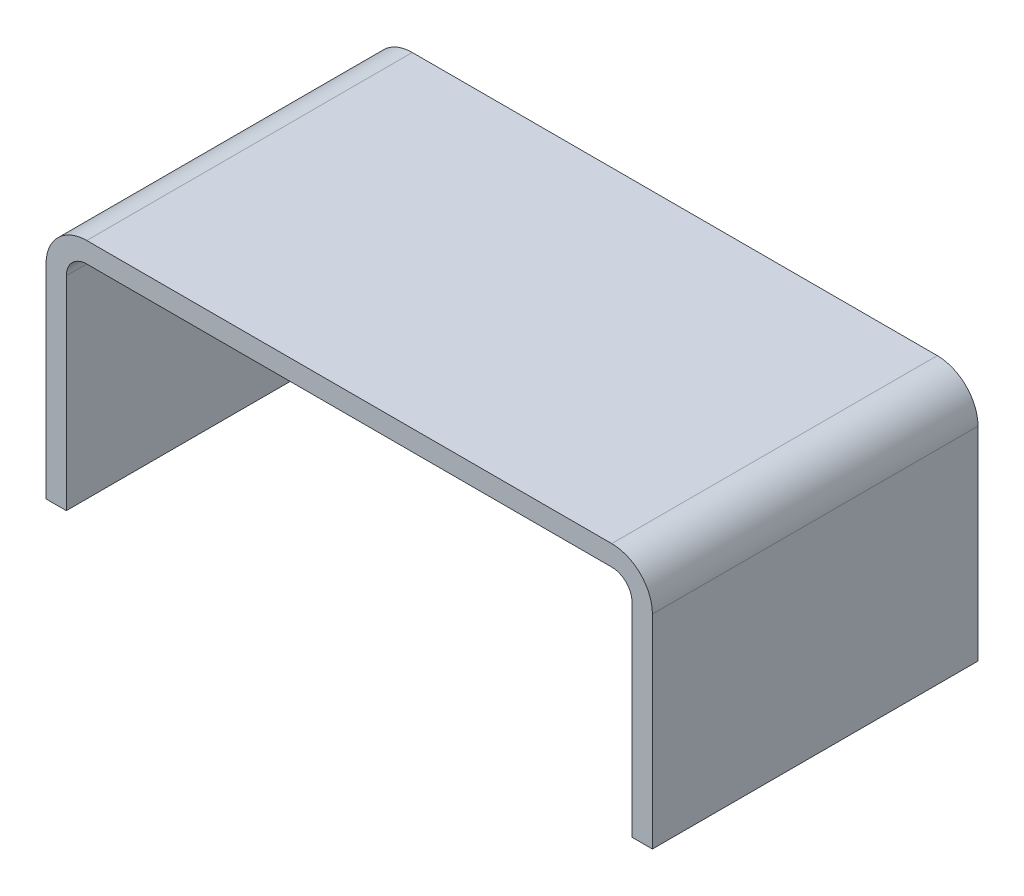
from build123d import *

# Parameters (mm, degrees)
BASE_EXTRUSION_DEPTH    = 1000
ESQUISSE2_W             = 300
ESQUISSE2_H             = 1040
ENL_V_MAT_EXTRU_1_DEPTH = 1013.818345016


with BuildPart() as part:
    # Esquisse1 → Base-Extrusion (new body)
    with BuildSketch(Plane.XY):
        with BuildLine():
            Line((144, 0), (149, 0))
            Line((149, 0), (149, 50))
            ThreePointArc((149, 50), (146.071067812, 57.071067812), (139, 60))
            Line((139, 60), (10, 60))
            ThreePointArc((10, 60), (2.928932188, 57.071067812), (0, 50))
            Line((0, 50), (0, 0))
            Line((0, 0), (5, 0))
            Line((5, 0), (5, 50))
            ThreePointArc((5, 50), (6.464466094, 53.535533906), (10, 55))
            Line((10, 55), (139, 55))
            ThreePointArc((139, 55), (142.535533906, 53.535533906), (144, 50))
            Line((144, 50), (144, 0))
        make_face()
    extrude(amount=BASE_EXTRUSION_DEPTH)

    # Esquisse2 → Enl_v. mat.-Extru.1 (cut, through all)
    with BuildSketch(Plane(origin=(0, 60, 0), x_dir=(-1, 0, 0), z_dir=(0, 1, 0))):
        with Locations((-90, 400)):
            Rectangle(ESQUISSE2_W, ESQUISSE2_H)
    extrude(amount=-ENL_V_MAT_EXTRU_1_DEPTH, mode=Mode.SUBTRACT)


solid = part.part
